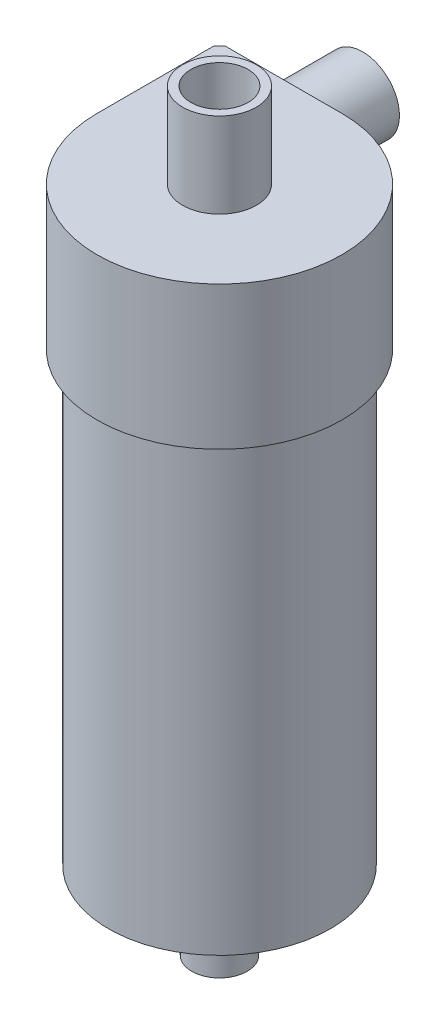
ISO-10303-21;
HEADER;
FILE_DESCRIPTION(('STEP AP214'),'2;1');
FILE_NAME('part.step','',(''),(''),'','','');
FILE_SCHEMA(('AUTOMOTIVE_DESIGN { 1 0 10303 214 1 1 1 1 }'));
ENDSEC;
DATA;
#1=APPLICATION_CONTEXT('core data for automotive mechanical design processes');
#2=APPLICATION_PROTOCOL_DEFINITION('international standard','automotive_design',2000,#1);
#3=PRODUCT_CONTEXT('',#1,'mechanical');
#4=PRODUCT('Part','Part','',(#3));
#5=PRODUCT_RELATED_PRODUCT_CATEGORY('part','',(#4));
#6=PRODUCT_DEFINITION_FORMATION('','',#4);
#7=PRODUCT_DEFINITION_CONTEXT('part definition',#1,'design');
#8=PRODUCT_DEFINITION('design','',#6,#7);
#9=PRODUCT_DEFINITION_SHAPE('','',#8);
#10=(LENGTH_UNIT() NAMED_UNIT(*) SI_UNIT(.MILLI.,.METRE.));
#11=(NAMED_UNIT(*) PLANE_ANGLE_UNIT() SI_UNIT($,.RADIAN.));
#12=(NAMED_UNIT(*) SI_UNIT($,.STERADIAN.) SOLID_ANGLE_UNIT());
#13=UNCERTAINTY_MEASURE_WITH_UNIT(LENGTH_MEASURE(1.E-05),#10,'distance_accuracy_value','');
#14=(GEOMETRIC_REPRESENTATION_CONTEXT(3) GLOBAL_UNCERTAINTY_ASSIGNED_CONTEXT((#13)) GLOBAL_UNIT_ASSIGNED_CONTEXT((#10,
#11,#12)) REPRESENTATION_CONTEXT('',''));
#15=CARTESIAN_POINT('',(0.,0.,0.));
#16=DIRECTION('',(0.,0.,1.));
#17=DIRECTION('',(1.,0.,0.));
#18=AXIS2_PLACEMENT_3D('',#15,#16,#17);
#19=CARTESIAN_POINT('',(-1.11022302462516E-13,-13.83,1.74999999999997));
#20=DIRECTION('',(0.,-1.,0.));
#21=DIRECTION('',(1.,0.,0.));
#22=AXIS2_PLACEMENT_3D('',#19,#20,#21);
#23=PLANE('',#22);
#24=CARTESIAN_POINT('',(-1.11022302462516E-13,-13.83,1.74999999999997));
#25=DIRECTION('',(0.,1.,0.));
#26=DIRECTION('',(-1.,0.,0.));
#27=AXIS2_PLACEMENT_3D('',#24,#25,#26);
#28=CIRCLE('',#27,0.75);
#29=CARTESIAN_POINT('',(-0.750000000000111,-13.83,1.74999999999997));
#30=VERTEX_POINT('',#29);
#31=EDGE_CURVE('E20',#30,#30,#28,.T.);
#32=ORIENTED_EDGE('',*,*,#31,.F.);
#33=EDGE_LOOP('',(#32));
#34=FACE_BOUND('',#33,.T.);
#35=ADVANCED_FACE('F17',(#34),#23,.T.);
#36=CARTESIAN_POINT('',(0.,-13.83,-1.75000000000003));
#37=DIRECTION('',(0.,-1.,0.));
#38=DIRECTION('',(1.,0.,0.));
#39=AXIS2_PLACEMENT_3D('',#36,#37,#38);
#40=PLANE('',#39);
#41=CARTESIAN_POINT('',(0.,-13.83,-1.75000000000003));
#42=DIRECTION('',(0.,1.,0.));
#43=DIRECTION('',(-1.,0.,0.));
#44=AXIS2_PLACEMENT_3D('',#41,#42,#43);
#45=CIRCLE('',#44,0.75);
#46=CARTESIAN_POINT('',(-0.749999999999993,-13.83,-1.75000000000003));
#47=VERTEX_POINT('',#46);
#48=EDGE_CURVE('E146',#47,#47,#45,.T.);
#49=ORIENTED_EDGE('',*,*,#48,.F.);
#50=EDGE_LOOP('',(#49));
#51=FACE_BOUND('',#50,.T.);
#52=ADVANCED_FACE('F157',(#51),#40,.T.);
#53=CARTESIAN_POINT('',(-1.11022302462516E-13,-13.83,1.74999999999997));
#54=DIRECTION('',(0.,1.,0.));
#55=DIRECTION('',(-1.,0.,0.));
#56=AXIS2_PLACEMENT_3D('',#53,#54,#55);
#57=CYLINDRICAL_SURFACE('',#56,0.75);
#58=ORIENTED_EDGE('',*,*,#31,.T.);
#59=EDGE_LOOP('',(#58));
#60=FACE_BOUND('',#59,.T.);
#61=CARTESIAN_POINT('',(-1.11513447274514E-13,-8.83000000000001,1.74999999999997));
#62=DIRECTION('',(0.,1.,0.));
#63=DIRECTION('',(-1.,0.,0.));
#64=AXIS2_PLACEMENT_3D('',#61,#62,#63);
#65=CIRCLE('',#64,0.75);
#66=CARTESIAN_POINT('',(-0.750000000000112,-8.83000000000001,1.74999999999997));
#67=VERTEX_POINT('',#66);
#68=EDGE_CURVE('E144',#67,#67,#65,.F.);
#69=ORIENTED_EDGE('',*,*,#68,.T.);
#70=EDGE_LOOP('',(#69));
#71=FACE_BOUND('',#70,.T.);
#72=ADVANCED_FACE('F153',(#60,#71),#57,.T.);
#73=CARTESIAN_POINT('',(0.,-13.83,-1.75000000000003));
#74=DIRECTION('',(0.,1.,0.));
#75=DIRECTION('',(-1.,0.,0.));
#76=AXIS2_PLACEMENT_3D('',#73,#74,#75);
#77=CYLINDRICAL_SURFACE('',#76,0.75);
#78=ORIENTED_EDGE('',*,*,#48,.T.);
#79=EDGE_LOOP('',(#78));
#80=FACE_BOUND('',#79,.T.);
#81=CARTESIAN_POINT('',(0.,-8.83000000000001,-1.75000000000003));
#82=DIRECTION('',(0.,1.,0.));
#83=DIRECTION('',(-1.,0.,0.));
#84=AXIS2_PLACEMENT_3D('',#81,#82,#83);
#85=CIRCLE('',#84,0.75);
#86=CARTESIAN_POINT('',(-0.749999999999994,-8.83000000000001,-1.75000000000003));
#87=VERTEX_POINT('',#86);
#88=EDGE_CURVE('E141',#87,#87,#85,.F.);
#89=ORIENTED_EDGE('',*,*,#88,.T.);
#90=EDGE_LOOP('',(#89));
#91=FACE_BOUND('',#90,.T.);
#92=ADVANCED_FACE('F249',(#80,#91),#77,.T.);
#93=CARTESIAN_POINT('',(0.,104.,0.));
#94=DIRECTION('',(0.,1.,0.));
#95=DIRECTION('',(0.,0.,1.));
#96=AXIS2_PLACEMENT_3D('',#93,#94,#95);
#97=PLANE('',#96);
#98=CARTESIAN_POINT('',(0.,104.,0.));
#99=DIRECTION('',(0.,-1.,0.));
#100=DIRECTION('',(0.,0.,-1.));
#101=AXIS2_PLACEMENT_3D('',#98,#99,#100);
#102=CIRCLE('',#101,5.05);
#103=CARTESIAN_POINT('',(0.,104.,-5.05000000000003));
#104=VERTEX_POINT('',#103);
#105=EDGE_CURVE('E138',#104,#104,#102,.F.);
#106=ORIENTED_EDGE('',*,*,#105,.T.);
#107=EDGE_LOOP('',(#106));
#108=FACE_BOUND('',#107,.T.);
#109=ADVANCED_FACE('F245',(#108),#97,.T.);
#110=CARTESIAN_POINT('',(4.,-8.83000000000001,0.));
#111=DIRECTION('',(0.,1.,0.));
#112=DIRECTION('',(-1.,0.,0.));
#113=AXIS2_PLACEMENT_3D('',#110,#111,#112);
#114=PLANE('',#113);
#115=ORIENTED_EDGE('',*,*,#88,.F.);
#116=EDGE_LOOP('',(#115));
#117=FACE_BOUND('',#116,.T.);
#118=CARTESIAN_POINT('',(0.,-8.83000000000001,0.));
#119=DIRECTION('',(0.,1.,0.));
#120=DIRECTION('',(-1.,0.,0.));
#121=AXIS2_PLACEMENT_3D('',#118,#119,#120);
#122=CIRCLE('',#121,4.);
#123=CARTESIAN_POINT('',(-4.,-8.83000000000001,0.));
#124=VERTEX_POINT('',#123);
#125=EDGE_CURVE('E135',#124,#124,#122,.F.);
#126=ORIENTED_EDGE('',*,*,#125,.T.);
#127=EDGE_LOOP('',(#126));
#128=FACE_BOUND('',#127,.T.);
#129=ORIENTED_EDGE('',*,*,#68,.F.);
#130=EDGE_LOOP('',(#129));
#131=FACE_BOUND('',#130,.T.);
#132=ADVANCED_FACE('F241',(#117,#128,#131),#114,.F.);
#133=CARTESIAN_POINT('',(0.,269.094025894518,-21.6));
#134=DIRECTION('',(0.,0.,1.));
#135=DIRECTION('',(1.,0.,0.));
#136=AXIS2_PLACEMENT_3D('',#133,#134,#135);
#137=PLANE('',#136);
#138=CARTESIAN_POINT('',(-11.35,93.75,-21.6));
#139=DIRECTION('',(0.,0.,1.));
#140=DIRECTION('',(1.,0.,0.));
#141=AXIS2_PLACEMENT_3D('',#138,#139,#140);
#142=CIRCLE('',#141,5.05);
#143=CARTESIAN_POINT('',(-6.29999999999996,93.75,-21.6));
#144=VERTEX_POINT('',#143);
#145=EDGE_CURVE('E132',#144,#144,#142,.F.);
#146=ORIENTED_EDGE('',*,*,#145,.T.);
#147=EDGE_LOOP('',(#146));
#148=FACE_BOUND('',#147,.T.);
#149=ADVANCED_FACE('F237',(#148),#137,.F.);
#150=CARTESIAN_POINT('',(0.,119.,0.));
#151=DIRECTION('',(0.,-1.,0.));
#152=DIRECTION('',(0.,0.,-1.));
#153=AXIS2_PLACEMENT_3D('',#150,#151,#152);
#154=CYLINDRICAL_SURFACE('',#153,5.05);
#155=CARTESIAN_POINT('',(0.,119.,0.));
#156=DIRECTION('',(0.,-1.,0.));
#157=DIRECTION('',(0.,0.,-1.));
#158=AXIS2_PLACEMENT_3D('',#155,#156,#157);
#159=CIRCLE('',#158,5.05);
#160=CARTESIAN_POINT('',(0.,119.,-5.05000000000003));
#161=VERTEX_POINT('',#160);
#162=EDGE_CURVE('E129',#161,#161,#159,.T.);
#163=ORIENTED_EDGE('',*,*,#162,.F.);
#164=EDGE_LOOP('',(#163));
#165=FACE_BOUND('',#164,.T.);
#166=ORIENTED_EDGE('',*,*,#105,.F.);
#167=EDGE_LOOP('',(#166));
#168=FACE_BOUND('',#167,.T.);
#169=ADVANCED_FACE('F233',(#165,#168),#154,.F.);
#170=CARTESIAN_POINT('',(0.,0.,0.));
#171=DIRECTION('',(0.,1.,0.));
#172=DIRECTION('',(-1.,0.,0.));
#173=AXIS2_PLACEMENT_3D('',#170,#171,#172);
#174=CYLINDRICAL_SURFACE('',#173,4.);
#175=CARTESIAN_POINT('',(0.,-13.83,0.));
#176=DIRECTION('',(0.,1.,0.));
#177=DIRECTION('',(-1.,0.,0.));
#178=AXIS2_PLACEMENT_3D('',#175,#176,#177);
#179=CIRCLE('',#178,4.);
#180=CARTESIAN_POINT('',(-4.,-13.83,0.));
#181=VERTEX_POINT('',#180);
#182=EDGE_CURVE('E126',#181,#181,#179,.F.);
#183=ORIENTED_EDGE('',*,*,#182,.T.);
#184=EDGE_LOOP('',(#183));
#185=FACE_BOUND('',#184,.T.);
#186=ORIENTED_EDGE('',*,*,#125,.F.);
#187=EDGE_LOOP('',(#186));
#188=FACE_BOUND('',#187,.T.);
#189=ADVANCED_FACE('F229',(#185,#188),#174,.F.);
#190=CARTESIAN_POINT('',(-11.35,93.75,-36.6000000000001));
#191=DIRECTION('',(0.,0.,1.));
#192=DIRECTION('',(1.,0.,0.));
#193=AXIS2_PLACEMENT_3D('',#190,#191,#192);
#194=CYLINDRICAL_SURFACE('',#193,5.05);
#195=CARTESIAN_POINT('',(-11.35,93.75,-36.6000000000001));
#196=DIRECTION('',(0.,0.,1.));
#197=DIRECTION('',(1.,0.,0.));
#198=AXIS2_PLACEMENT_3D('',#195,#196,#197);
#199=CIRCLE('',#198,5.05);
#200=CARTESIAN_POINT('',(-6.29999999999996,93.75,-36.6000000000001));
#201=VERTEX_POINT('',#200);
#202=EDGE_CURVE('E123',#201,#201,#199,.F.);
#203=ORIENTED_EDGE('',*,*,#202,.T.);
#204=EDGE_LOOP('',(#203));
#205=FACE_BOUND('',#204,.T.);
#206=ORIENTED_EDGE('',*,*,#145,.F.);
#207=EDGE_LOOP('',(#206));
#208=FACE_BOUND('',#207,.T.);
#209=ADVANCED_FACE('F225',(#205,#208),#194,.F.);
#210=CARTESIAN_POINT('',(0.,119.,0.));
#211=DIRECTION('',(0.,1.,0.));
#212=DIRECTION('',(0.,0.,1.));
#213=AXIS2_PLACEMENT_3D('',#210,#211,#212);
#214=PLANE('',#213);
#215=ORIENTED_EDGE('',*,*,#162,.T.);
#216=EDGE_LOOP('',(#215));
#217=FACE_BOUND('',#216,.T.);
#218=CARTESIAN_POINT('',(0.,119.,0.));
#219=DIRECTION('',(0.,-1.,0.));
#220=DIRECTION('',(0.,0.,-1.));
#221=AXIS2_PLACEMENT_3D('',#218,#219,#220);
#222=CIRCLE('',#221,6.5);
#223=CARTESIAN_POINT('',(0.,119.,-6.50000000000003));
#224=VERTEX_POINT('',#223);
#225=EDGE_CURVE('E120',#224,#224,#222,.T.);
#226=ORIENTED_EDGE('',*,*,#225,.F.);
#227=EDGE_LOOP('',(#226));
#228=FACE_BOUND('',#227,.T.);
#229=ADVANCED_FACE('F221',(#217,#228),#214,.T.);
#230=CARTESIAN_POINT('',(4.8999999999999,-13.83,0.));
#231=DIRECTION('',(0.,1.,0.));
#232=DIRECTION('',(-1.,0.,0.));
#233=AXIS2_PLACEMENT_3D('',#230,#231,#232);
#234=PLANE('',#233);
#235=ORIENTED_EDGE('',*,*,#182,.F.);
#236=EDGE_LOOP('',(#235));
#237=FACE_BOUND('',#236,.T.);
#238=CARTESIAN_POINT('',(0.,-13.83,0.));
#239=DIRECTION('',(0.,1.,0.));
#240=DIRECTION('',(-1.,0.,0.));
#241=AXIS2_PLACEMENT_3D('',#238,#239,#240);
#242=CIRCLE('',#241,4.9);
#243=CARTESIAN_POINT('',(-4.9,-13.83,0.));
#244=VERTEX_POINT('',#243);
#245=EDGE_CURVE('E117',#244,#244,#242,.T.);
#246=ORIENTED_EDGE('',*,*,#245,.F.);
#247=EDGE_LOOP('',(#246));
#248=FACE_BOUND('',#247,.T.);
#249=ADVANCED_FACE('F217',(#237,#248),#234,.F.);
#250=CARTESIAN_POINT('',(-11.35,93.75,-36.6000000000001));
#251=DIRECTION('',(0.,0.,1.));
#252=DIRECTION('',(1.,0.,0.));
#253=AXIS2_PLACEMENT_3D('',#250,#251,#252);
#254=PLANE('',#253);
#255=CARTESIAN_POINT('',(-11.35,93.75,-36.6000000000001));
#256=DIRECTION('',(0.,0.,1.));
#257=DIRECTION('',(1.,0.,0.));
#258=AXIS2_PLACEMENT_3D('',#255,#256,#257);
#259=CIRCLE('',#258,6.50000000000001);
#260=CARTESIAN_POINT('',(-4.84999999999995,93.75,-36.6000000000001));
#261=VERTEX_POINT('',#260);
#262=EDGE_CURVE('E90',#261,#261,#259,.T.);
#263=ORIENTED_EDGE('',*,*,#262,.F.);
#264=EDGE_LOOP('',(#263));
#265=FACE_BOUND('',#264,.T.);
#266=ORIENTED_EDGE('',*,*,#202,.F.);
#267=EDGE_LOOP('',(#266));
#268=FACE_BOUND('',#267,.T.);
#269=ADVANCED_FACE('F213',(#265,#268),#254,.F.);
#270=CARTESIAN_POINT('',(0.,119.,0.));
#271=DIRECTION('',(0.,-1.,0.));
#272=DIRECTION('',(0.,0.,-1.));
#273=AXIS2_PLACEMENT_3D('',#270,#271,#272);
#274=CYLINDRICAL_SURFACE('',#273,6.5);
#275=CARTESIAN_POINT('',(0.,104.,0.));
#276=DIRECTION('',(0.,-1.,0.));
#277=DIRECTION('',(0.,0.,-1.));
#278=AXIS2_PLACEMENT_3D('',#275,#276,#277);
#279=CIRCLE('',#278,6.5);
#280=CARTESIAN_POINT('',(0.,104.,-6.50000000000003));
#281=VERTEX_POINT('',#280);
#282=EDGE_CURVE('E73',#281,#281,#279,.T.);
#283=ORIENTED_EDGE('',*,*,#282,.F.);
#284=EDGE_LOOP('',(#283));
#285=FACE_BOUND('',#284,.T.);
#286=ORIENTED_EDGE('',*,*,#225,.T.);
#287=EDGE_LOOP('',(#286));
#288=FACE_BOUND('',#287,.T.);
#289=ADVANCED_FACE('F209',(#285,#288),#274,.T.);
#290=CARTESIAN_POINT('',(0.,0.,0.));
#291=DIRECTION('',(0.,1.,0.));
#292=DIRECTION('',(-1.,0.,0.));
#293=AXIS2_PLACEMENT_3D('',#290,#291,#292);
#294=CYLINDRICAL_SURFACE('',#293,4.9);
#295=CARTESIAN_POINT('',(0.,-3.65000000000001,0.));
#296=DIRECTION('',(0.,1.,0.));
#297=DIRECTION('',(-1.,0.,0.));
#298=AXIS2_PLACEMENT_3D('',#295,#296,#297);
#299=CIRCLE('',#298,4.9);
#300=CARTESIAN_POINT('',(-4.9,-3.65000000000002,0.));
#301=VERTEX_POINT('',#300);
#302=EDGE_CURVE('E110',#301,#301,#299,.F.);
#303=ORIENTED_EDGE('',*,*,#302,.T.);
#304=EDGE_LOOP('',(#303));
#305=FACE_BOUND('',#304,.T.);
#306=ORIENTED_EDGE('',*,*,#245,.T.);
#307=EDGE_LOOP('',(#306));
#308=FACE_BOUND('',#307,.T.);
#309=ADVANCED_FACE('F205',(#305,#308),#294,.T.);
#310=CARTESIAN_POINT('',(-11.35,93.75,-36.6000000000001));
#311=DIRECTION('',(0.,0.,1.));
#312=DIRECTION('',(1.,0.,0.));
#313=AXIS2_PLACEMENT_3D('',#310,#311,#312);
#314=CYLINDRICAL_SURFACE('',#313,6.50000000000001);
#315=CARTESIAN_POINT('',(-11.35,93.75,-21.6));
#316=DIRECTION('',(0.,0.,1.));
#317=DIRECTION('',(1.,0.,0.));
#318=AXIS2_PLACEMENT_3D('',#315,#316,#317);
#319=CIRCLE('',#318,6.50000000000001);
#320=CARTESIAN_POINT('',(-4.84999999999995,93.75,-21.6));
#321=VERTEX_POINT('',#320);
#322=EDGE_CURVE('E106',#321,#321,#319,.F.);
#323=ORIENTED_EDGE('',*,*,#322,.T.);
#324=EDGE_LOOP('',(#323));
#325=FACE_BOUND('',#324,.T.);
#326=ORIENTED_EDGE('',*,*,#262,.T.);
#327=EDGE_LOOP('',(#326));
#328=FACE_BOUND('',#327,.T.);
#329=ADVANCED_FACE('F202',(#325,#328),#314,.T.);
#330=CARTESIAN_POINT('',(-21.6,269.094025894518,-20.6));
#331=DIRECTION('',(0.707106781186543,0.,0.707106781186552));
#332=DIRECTION('',(0.707106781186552,0.,-0.707106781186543));
#333=AXIS2_PLACEMENT_3D('',#330,#331,#332);
#334=PLANE('',#333);
#335=DIRECTION('',(0.,1.,0.));
#336=VECTOR('',#335,1.);
#337=CARTESIAN_POINT('',(-20.6,269.094025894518,-21.6));
#338=LINE('',#337,#336);
#339=CARTESIAN_POINT('',(-20.6,104.,-21.6));
#340=VERTEX_POINT('',#339);
#341=CARTESIAN_POINT('',(-20.6,78.7499999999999,-21.6));
#342=VERTEX_POINT('',#341);
#343=EDGE_CURVE('E94',#340,#342,#338,.F.);
#344=ORIENTED_EDGE('',*,*,#343,.T.);
#345=DIRECTION('',(0.707106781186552,0.,-0.707106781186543));
#346=VECTOR('',#345,1.);
#347=CARTESIAN_POINT('',(-21.6,78.7499999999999,-20.6));
#348=LINE('',#347,#346);
#349=CARTESIAN_POINT('',(-21.6,78.7499999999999,-20.6));
#350=VERTEX_POINT('',#349);
#351=EDGE_CURVE('E35',#350,#342,#348,.T.);
#352=ORIENTED_EDGE('',*,*,#351,.F.);
#353=DIRECTION('',(0.,1.,0.));
#354=VECTOR('',#353,1.);
#355=CARTESIAN_POINT('',(-21.6,269.094025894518,-20.6));
#356=LINE('',#355,#354);
#357=CARTESIAN_POINT('',(-21.6,104.,-20.6));
#358=VERTEX_POINT('',#357);
#359=EDGE_CURVE('E59',#350,#358,#356,.T.);
#360=ORIENTED_EDGE('',*,*,#359,.T.);
#361=DIRECTION('',(-0.707106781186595,0.,0.7071067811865));
#362=VECTOR('',#361,1.);
#363=CARTESIAN_POINT('',(-20.6,104.,-21.6));
#364=LINE('',#363,#362);
#365=EDGE_CURVE('E57',#340,#358,#364,.T.);
#366=ORIENTED_EDGE('',*,*,#365,.F.);
#367=EDGE_LOOP('',(#344,#352,#360,#366));
#368=FACE_BOUND('',#367,.T.);
#369=ADVANCED_FACE('F60',(#368),#334,.F.);
#370=CARTESIAN_POINT('',(0.,104.,0.));
#371=DIRECTION('',(0.,1.,0.));
#372=DIRECTION('',(0.,0.,1.));
#373=AXIS2_PLACEMENT_3D('',#370,#371,#372);
#374=PLANE('',#373);
#375=ORIENTED_EDGE('',*,*,#282,.T.);
#376=EDGE_LOOP('',(#375));
#377=FACE_BOUND('',#376,.T.);
#378=DIRECTION('',(0.,0.,-1.));
#379=VECTOR('',#378,1.);
#380=CARTESIAN_POINT('',(-21.6,104.,-21.6));
#381=LINE('',#380,#379);
#382=CARTESIAN_POINT('',(-21.6,104.,0.));
#383=VERTEX_POINT('',#382);
#384=EDGE_CURVE('E65',#358,#383,#381,.F.);
#385=ORIENTED_EDGE('',*,*,#384,.T.);
#386=CARTESIAN_POINT('',(0.,104.,0.));
#387=DIRECTION('',(0.,-1.,0.));
#388=DIRECTION('',(0.,0.,-1.));
#389=AXIS2_PLACEMENT_3D('',#386,#387,#388);
#390=CIRCLE('',#389,21.6);
#391=CARTESIAN_POINT('',(0.,104.,-21.6));
#392=VERTEX_POINT('',#391);
#393=EDGE_CURVE('E53',#392,#383,#390,.T.);
#394=ORIENTED_EDGE('',*,*,#393,.F.);
#395=DIRECTION('',(1.,0.,0.));
#396=VECTOR('',#395,1.);
#397=CARTESIAN_POINT('',(0.,104.,-21.6));
#398=LINE('',#397,#396);
#399=EDGE_CURVE('E71',#392,#340,#398,.F.);
#400=ORIENTED_EDGE('',*,*,#399,.T.);
#401=ORIENTED_EDGE('',*,*,#365,.T.);
#402=EDGE_LOOP('',(#385,#394,#400,#401));
#403=FACE_BOUND('',#402,.T.);
#404=ADVANCED_FACE('F68',(#377,#403),#374,.T.);
#405=CARTESIAN_POINT('',(6.34999999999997,-3.65000000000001,0.));
#406=DIRECTION('',(0.,1.,0.));
#407=DIRECTION('',(-1.,0.,0.));
#408=AXIS2_PLACEMENT_3D('',#405,#406,#407);
#409=PLANE('',#408);
#410=ORIENTED_EDGE('',*,*,#302,.F.);
#411=EDGE_LOOP('',(#410));
#412=FACE_BOUND('',#411,.T.);
#413=CARTESIAN_POINT('',(0.,-3.65000000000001,0.));
#414=DIRECTION('',(0.,1.,0.));
#415=DIRECTION('',(-1.,0.,0.));
#416=AXIS2_PLACEMENT_3D('',#413,#414,#415);
#417=CIRCLE('',#416,6.35);
#418=CARTESIAN_POINT('',(-6.35,-3.65000000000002,0.));
#419=VERTEX_POINT('',#418);
#420=EDGE_CURVE('E76',#419,#419,#417,.T.);
#421=ORIENTED_EDGE('',*,*,#420,.F.);
#422=EDGE_LOOP('',(#421));
#423=FACE_BOUND('',#422,.T.);
#424=ADVANCED_FACE('F192',(#412,#423),#409,.F.);
#425=CARTESIAN_POINT('',(0.,269.094025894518,0.));
#426=DIRECTION('',(0.,-1.,0.));
#427=DIRECTION('',(0.,0.,-1.));
#428=AXIS2_PLACEMENT_3D('',#425,#426,#427);
#429=CYLINDRICAL_SURFACE('',#428,21.6);
#430=CARTESIAN_POINT('',(0.,78.75,0.));
#431=DIRECTION('',(0.,-1.,0.));
#432=DIRECTION('',(0.,0.,-1.));
#433=AXIS2_PLACEMENT_3D('',#430,#431,#432);
#434=CIRCLE('',#433,21.6);
#435=CARTESIAN_POINT('',(-21.6000000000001,78.75,0.));
#436=VERTEX_POINT('',#435);
#437=CARTESIAN_POINT('',(0.,78.75,-21.6));
#438=VERTEX_POINT('',#437);
#439=EDGE_CURVE('E79',#436,#438,#434,.F.);
#440=ORIENTED_EDGE('',*,*,#439,.T.);
#441=DIRECTION('',(0.,1.,0.));
#442=VECTOR('',#441,1.);
#443=CARTESIAN_POINT('',(0.,269.094025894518,-21.6));
#444=LINE('',#443,#442);
#445=EDGE_CURVE('E95',#438,#392,#444,.T.);
#446=ORIENTED_EDGE('',*,*,#445,.T.);
#447=ORIENTED_EDGE('',*,*,#393,.T.);
#448=DIRECTION('',(0.,1.,0.));
#449=VECTOR('',#448,1.);
#450=CARTESIAN_POINT('',(-21.6,269.094025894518,1.07552855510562E-13));
#451=LINE('',#450,#449);
#452=EDGE_CURVE('E66',#383,#436,#451,.F.);
#453=ORIENTED_EDGE('',*,*,#452,.T.);
#454=EDGE_LOOP('',(#440,#446,#447,#453));
#455=FACE_BOUND('',#454,.T.);
#456=ADVANCED_FACE('F188',(#455),#429,.T.);
#457=CARTESIAN_POINT('',(0.,269.094025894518,-21.6));
#458=DIRECTION('',(0.,0.,1.));
#459=DIRECTION('',(1.,0.,0.));
#460=AXIS2_PLACEMENT_3D('',#457,#458,#459);
#461=PLANE('',#460);
#462=ORIENTED_EDGE('',*,*,#343,.F.);
#463=ORIENTED_EDGE('',*,*,#399,.F.);
#464=ORIENTED_EDGE('',*,*,#445,.F.);
#465=DIRECTION('',(1.,0.,0.));
#466=VECTOR('',#465,1.);
#467=CARTESIAN_POINT('',(0.,78.75,-21.6));
#468=LINE('',#467,#466);
#469=EDGE_CURVE('E104',#438,#342,#468,.F.);
#470=ORIENTED_EDGE('',*,*,#469,.T.);
#471=EDGE_LOOP('',(#462,#463,#464,#470));
#472=FACE_BOUND('',#471,.T.);
#473=ORIENTED_EDGE('',*,*,#322,.F.);
#474=EDGE_LOOP('',(#473));
#475=FACE_BOUND('',#474,.T.);
#476=ADVANCED_FACE('F185',(#472,#475),#461,.F.);
#477=CARTESIAN_POINT('',(-21.6,269.094025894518,-21.6));
#478=DIRECTION('',(1.,0.,0.));
#479=DIRECTION('',(0.,0.,-1.));
#480=AXIS2_PLACEMENT_3D('',#477,#478,#479);
#481=PLANE('',#480);
#482=ORIENTED_EDGE('',*,*,#359,.F.);
#483=DIRECTION('',(0.,0.,1.));
#484=VECTOR('',#483,1.);
#485=CARTESIAN_POINT('',(-21.6000000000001,78.75,0.));
#486=LINE('',#485,#484);
#487=EDGE_CURVE('E103',#350,#436,#486,.T.);
#488=ORIENTED_EDGE('',*,*,#487,.T.);
#489=ORIENTED_EDGE('',*,*,#452,.F.);
#490=ORIENTED_EDGE('',*,*,#384,.F.);
#491=EDGE_LOOP('',(#482,#488,#489,#490));
#492=FACE_BOUND('',#491,.T.);
#493=ADVANCED_FACE('F75',(#492),#481,.F.);
#494=CARTESIAN_POINT('',(0.,0.,0.));
#495=DIRECTION('',(0.,1.,0.));
#496=DIRECTION('',(-1.,0.,0.));
#497=AXIS2_PLACEMENT_3D('',#494,#495,#496);
#498=CYLINDRICAL_SURFACE('',#497,6.35);
#499=ORIENTED_EDGE('',*,*,#420,.T.);
#500=EDGE_LOOP('',(#499));
#501=FACE_BOUND('',#500,.T.);
#502=CARTESIAN_POINT('',(0.,0.,0.));
#503=DIRECTION('',(0.,1.,0.));
#504=DIRECTION('',(-1.,0.,0.));
#505=AXIS2_PLACEMENT_3D('',#502,#503,#504);
#506=CIRCLE('',#505,6.35);
#507=CARTESIAN_POINT('',(-6.35,0.,0.));
#508=VERTEX_POINT('',#507);
#509=EDGE_CURVE('E100',#508,#508,#506,.F.);
#510=ORIENTED_EDGE('',*,*,#509,.T.);
#511=EDGE_LOOP('',(#510));
#512=FACE_BOUND('',#511,.T.);
#513=ADVANCED_FACE('F178',(#501,#512),#498,.T.);
#514=CARTESIAN_POINT('',(0.,78.75,0.));
#515=DIRECTION('',(0.,1.,0.));
#516=DIRECTION('',(0.,0.,1.));
#517=AXIS2_PLACEMENT_3D('',#514,#515,#516);
#518=PLANE('',#517);
#519=CARTESIAN_POINT('',(0.,78.75,0.));
#520=DIRECTION('',(0.,-1.,0.));
#521=DIRECTION('',(0.,0.,-1.));
#522=AXIS2_PLACEMENT_3D('',#519,#520,#521);
#523=CIRCLE('',#522,19.575);
#524=CARTESIAN_POINT('',(0.,78.75,-19.575));
#525=VERTEX_POINT('',#524);
#526=EDGE_CURVE('E26',#525,#525,#523,.T.);
#527=ORIENTED_EDGE('',*,*,#526,.F.);
#528=EDGE_LOOP('',(#527));
#529=FACE_BOUND('',#528,.T.);
#530=ORIENTED_EDGE('',*,*,#351,.T.);
#531=ORIENTED_EDGE('',*,*,#469,.F.);
#532=ORIENTED_EDGE('',*,*,#439,.F.);
#533=ORIENTED_EDGE('',*,*,#487,.F.);
#534=EDGE_LOOP('',(#530,#531,#532,#533));
#535=FACE_BOUND('',#534,.T.);
#536=ADVANCED_FACE('F171',(#529,#535),#518,.F.);
#537=CARTESIAN_POINT('',(0.,0.,0.));
#538=DIRECTION('',(0.,1.,0.));
#539=DIRECTION('',(0.,0.,1.));
#540=AXIS2_PLACEMENT_3D('',#537,#538,#539);
#541=PLANE('',#540);
#542=ORIENTED_EDGE('',*,*,#509,.F.);
#543=EDGE_LOOP('',(#542));
#544=FACE_BOUND('',#543,.T.);
#545=CARTESIAN_POINT('',(0.,0.,0.));
#546=DIRECTION('',(0.,-1.,0.));
#547=DIRECTION('',(0.,0.,-1.));
#548=AXIS2_PLACEMENT_3D('',#545,#546,#547);
#549=CIRCLE('',#548,19.575);
#550=CARTESIAN_POINT('',(0.,0.,-19.575));
#551=VERTEX_POINT('',#550);
#552=EDGE_CURVE('E11',#551,#551,#549,.F.);
#553=ORIENTED_EDGE('',*,*,#552,.F.);
#554=EDGE_LOOP('',(#553));
#555=FACE_BOUND('',#554,.T.);
#556=ADVANCED_FACE('F165',(#544,#555),#541,.F.);
#557=CARTESIAN_POINT('',(0.,78.75,0.));
#558=DIRECTION('',(0.,-1.,0.));
#559=DIRECTION('',(0.,0.,-1.));
#560=AXIS2_PLACEMENT_3D('',#557,#558,#559);
#561=CYLINDRICAL_SURFACE('',#560,19.575);
#562=ORIENTED_EDGE('',*,*,#552,.T.);
#563=EDGE_LOOP('',(#562));
#564=FACE_BOUND('',#563,.T.);
#565=ORIENTED_EDGE('',*,*,#526,.T.);
#566=EDGE_LOOP('',(#565));
#567=FACE_BOUND('',#566,.T.);
#568=ADVANCED_FACE('F163',(#564,#567),#561,.T.);
#569=CLOSED_SHELL('',(#35,#52,#72,#92,#109,#132,#149,#169,#189,#209,#229,#249,#269,#289,#309,
#329,#369,#404,#424,#456,#476,#493,#513,#536,#556,#568));
#570=MANIFOLD_SOLID_BREP('B1',#569);
#571=ADVANCED_BREP_SHAPE_REPRESENTATION('',(#18,#570),#14);
#572=SHAPE_DEFINITION_REPRESENTATION(#9,#571);
ENDSEC;
END-ISO-10303-21;
